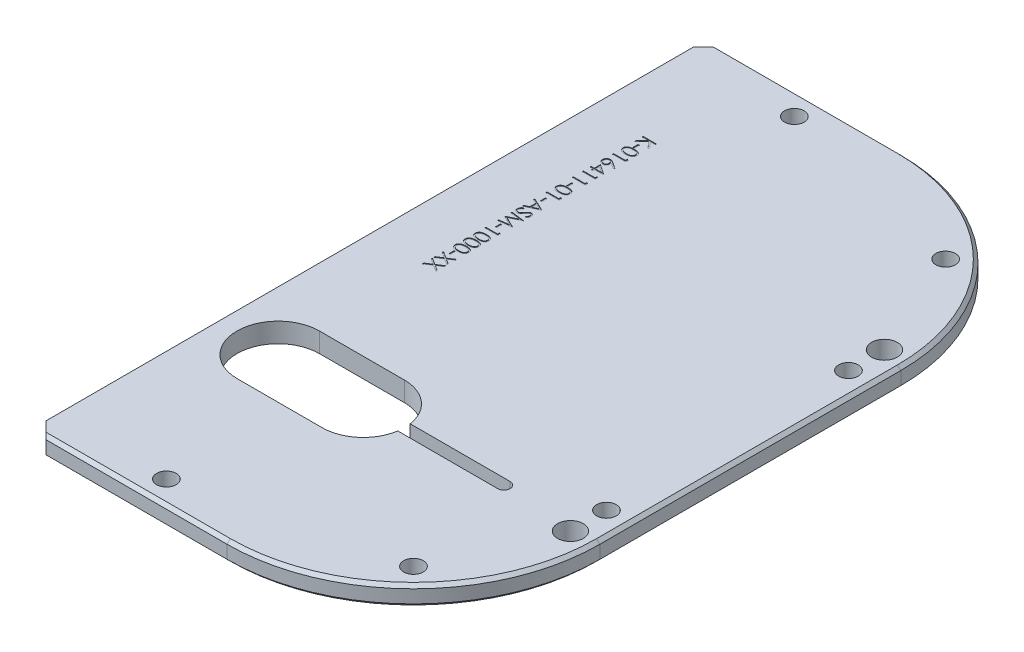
from build123d import *

# Parameters (mm, degrees)
SKETCH1_W             = 254
SKETCH1_H             = 330.2
BOSS_EXTRUDE1_DEPTH   = 4.7625
SKETCH2_OUTSIDE_W     = 339.34
SKETCH2_OUTSIDE_H     = 415.54
CUT_EXTRUDE1_DEPTH    = 9.525
CUT_EXTRUDE2_DEPTH    = 207.008328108
CUT_EXTRUDE3_DEPTH    = 207.008328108
HOLE1_D               = 9.525
HOLE1_DEPTH           = 88.9
SKETCH7_W             = 0.651282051
SKETCH7_H             = 2.442307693
SKETCH7_H_2           = 2.442307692
CUT_EXTRUDE4_DEPTH    = 0.254
MOVE_FACE1_BY         = 1.5875
MOVE_FACE1_2_BY       = 1.5875
MOVE_FACE1_3_BY       = 1.5875
MOVE_FACE1_4_BY       = 1.5875
MOVE_FACE1_5_BY       = 1.5875
CHAMFER2_SIZE         = 1.5875
M12_CLEARANCE_HOLE1_D = 12.5
CHAMFER3_SIZE         = 6.35


with BuildPart() as part:
    # Sketch1 → Boss-Extrude1 (new, symmetric)
    with BuildSketch(Plane(origin=(0, 0, 0), x_dir=(1, 0, 0), z_dir=(0, 1, 0))):
        Rectangle(SKETCH1_W, SKETCH1_H)
    extrude(amount=BOSS_EXTRUDE1_DEPTH, both=True)

    # Sketch2 outside → Cut-Extrude1 (cut)
    with BuildSketch(Plane(origin=(0, 4.7625, 0), x_dir=(1, 0, 0), z_dir=(0, 1, 0))):
        Rectangle(SKETCH2_OUTSIDE_W, SKETCH2_OUTSIDE_H)
        with BuildLine():
            Line((-127, -161.925), (-32.769613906, -161.925))
            ThreePointArc((-32.769613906, -161.925), (30.092178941, -135.886792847), (56.130386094, -73.025))
            Line((56.130386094, -73.025), (56.130386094, 73.025))
            ThreePointArc((56.130386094, 73.025), (30.092178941, 135.886792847), (-32.769613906, 161.925))
            Line((-32.769613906, 161.925), (-127, 161.925))
            Line((-127, 161.925), (-127, -161.925))
        make_face(mode=Mode.SUBTRACT)
    extrude(amount=-CUT_EXTRUDE1_DEPTH, mode=Mode.SUBTRACT)

    # Sketch3 → Cut-Extrude2 (cut, through all)
    with BuildSketch(Plane(origin=(0, 4.7625, 0), x_dir=(1, 0, 0), z_dir=(0, 1, 0))):
        with BuildLine():
            Line((-42.8625, -70.01), (11.1125, -70.01))
            ThreePointArc((11.1125, -70.01), (14.1275, -73.025), (11.1125, -76.04))
            Line((11.1125, -76.04), (-42.8625, -76.04))
            ThreePointArc((-42.8625, -76.04), (-45.8775, -73.025), (-42.8625, -70.01))
        make_face()
    extrude(amount=-CUT_EXTRUDE2_DEPTH, mode=Mode.SUBTRACT)

    # Sketch4 → Cut-Extrude3 (cut, through all)
    with BuildSketch(Plane(origin=(0, 4.7625, 0), x_dir=(1, 0, 0), z_dir=(0, 1, 0))):
        with BuildLine():
            Line((-98.425, -53.025), (-57.15, -53.025))
            ThreePointArc((-57.15, -53.025), (-37.15, -73.025), (-57.15, -93.025))
            Line((-57.15, -93.025), (-98.425, -93.025))
            ThreePointArc((-98.425, -93.025), (-118.425, -73.025), (-98.425, -53.025))
        make_face()
    extrude(amount=-CUT_EXTRUDE3_DEPTH, mode=Mode.SUBTRACT)

    # Hole1
    with Locations(Plane(origin=(0, 4.7625, 0), x_dir=(1, 0, 0), z_dir=(0, 1, 0))):
        with Locations((-73.314363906, 152.4), (23.356986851, 129.151600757), (46.605386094, 58.7375), (46.605386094, -58.7375), (23.356986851, -129.151600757), (-73.314363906, -152.4)):
            Hole(HOLE1_D / 2, depth=HOLE1_DEPTH)

    # Sketch7 → Cut-Extrude4 (cut)
    # profile 1 of 23: a face of its own
    with BuildSketch(Plane(origin=(0, 4.7625, 0), x_dir=(1, 0, 0), z_dir=(0, 1, 0))):
        Polygon((-95.25, 107.339423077), (-95.25, 106.769551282), (-97.668139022, 106.769551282), (-95.25, 104.122445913), (-95.25, 103.309615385), (-98.099358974, 106.429917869), (-101.6, 103.065384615), (-101.6, 103.824789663), (-98.535667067, 106.769551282), (-101.6, 106.769551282), (-101.6, 107.339423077), align=None)
    # profile 2 of 23: a face of its own
    with BuildSketch(Plane(origin=(0, 4.7625, 0), x_dir=(1, 0, 0), z_dir=(0, 1, 0))):
        with Locations((-99.157692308, 101.477884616)):
            Rectangle(SKETCH7_W, SKETCH7_H)
    # profile 3 of 23: a face of its own
    with BuildSketch(Plane(origin=(0, 4.7625, 0), x_dir=(1, 0, 0), z_dir=(0, 1, 0))):
        with BuildLine():
            add(Edge.make_bspline(
                [(-98.427544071, 99.768269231), (-98.325767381, 99.767674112), (-98.128064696, 99.766518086), (-97.839983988, 99.753657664), (-97.569727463, 99.73229383), (-97.31728219, 99.703016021), (-97.082582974, 99.667387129), (-96.866257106, 99.619824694), (-96.667303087, 99.565735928), (-96.485073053, 99.503047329), (-96.317108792, 99.432314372), (-96.160315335, 99.355319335), (-96.014891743, 99.269048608), (-95.878653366, 99.178285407), (-95.753120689, 99.079713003), (-95.63853144, 98.974371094), (-95.534816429, 98.861214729), (-95.440741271, 98.742481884), (-95.358789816, 98.617422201), (-95.284946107, 98.489890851), (-95.22433806, 98.357637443), (-95.174537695, 98.221868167), (-95.134633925, 98.082977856), (-95.107000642, 97.940392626), (-95.089682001, 97.794078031), (-95.088021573, 97.695324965), (-95.087179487, 97.645242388)],
                knots=[0, 0, 0, 0, 1.646377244, 3.198111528, 4.663803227, 6.031090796, 7.308794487, 8.502186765, 9.612154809, 10.642545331, 11.617106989, 12.558866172, 13.465886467, 14.35053239, 15.20542558, 16.045215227, 16.865619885, 17.686225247, 18.492864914, 19.282407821, 20.068097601, 20.842842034, 21.620163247, 22.403093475, 23.190129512, 24, 24, 24, 24], degree=3))
            add(Edge.make_bspline(
                [(-95.087179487, 97.645242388), (-95.088064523, 97.594740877), (-95.089824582, 97.494309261), (-95.106740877, 97.345827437), (-95.134809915, 97.200775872), (-95.174580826, 97.059772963), (-95.223921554, 96.921660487), (-95.285765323, 96.787518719), (-95.357754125, 96.656514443), (-95.44234316, 96.530729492), (-95.536653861, 96.408782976), (-95.643266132, 96.293670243), (-95.761103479, 96.185380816), (-95.888905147, 96.082555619), (-96.029122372, 95.988111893), (-96.1793164, 95.898171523), (-96.342113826, 95.817667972), (-96.514798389, 95.740135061), (-96.70214817, 95.673211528), (-96.903107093, 95.612857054), (-97.120048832, 95.564090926), (-97.351835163, 95.523470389), (-97.599317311, 95.492001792), (-97.861964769, 95.46908257), (-98.139950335, 95.456975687), (-98.330011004, 95.454695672), (-98.427544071, 95.453525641)],
                knots=[0, 0, 0, 0, 0.810914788, 1.612654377, 2.396697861, 3.181598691, 3.963628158, 4.749916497, 5.551656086, 6.361998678, 7.18212741, 8.025565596, 8.878627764, 9.750805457, 10.657531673, 11.591944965, 12.560506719, 13.57287815, 14.630710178, 15.753379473, 16.941251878, 18.199788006, 19.531962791, 20.947069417, 22.433333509, 24, 24, 24, 24], degree=3))
            add(Edge.make_bspline(
                [(-98.427544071, 95.453525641), (-98.524651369, 95.454709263), (-98.71386098, 95.457015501), (-98.990600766, 95.468930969), (-99.251836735, 95.492512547), (-99.498296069, 95.521679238), (-99.728515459, 95.563226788), (-99.944684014, 95.610459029), (-100.144936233, 95.669163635), (-100.331297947, 95.735174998), (-100.503136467, 95.811025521), (-100.664526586, 95.892240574), (-100.814598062, 95.981628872), (-100.954813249, 96.076635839), (-101.083723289, 96.178587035), (-101.201646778, 96.287335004), (-101.308505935, 96.402962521), (-101.404105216, 96.525184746), (-101.487709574, 96.65294847), (-101.562438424, 96.783515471), (-101.623076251, 96.919491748), (-101.674273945, 97.057855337), (-101.71413635, 97.199911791), (-101.74142987, 97.345521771), (-101.760624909, 97.494208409), (-101.762086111, 97.594723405), (-101.762820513, 97.645242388)],
                knots=[0, 0, 0, 0, 1.56130642, 3.042141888, 4.451772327, 5.777565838, 7.030558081, 8.211376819, 9.333164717, 10.383253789, 11.387583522, 12.350962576, 13.286244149, 14.193812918, 15.072134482, 15.925989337, 16.770211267, 17.600669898, 18.417446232, 19.22325363, 20.01647746, 20.807971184, 21.593601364, 22.38506573, 23.188331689, 24, 24, 24, 24], degree=3))
            add(Edge.make_bspline(
                [(-101.762820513, 97.645242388), (-101.761970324, 97.69532293), (-101.760293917, 97.794071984), (-101.743092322, 97.940415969), (-101.715042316, 98.082778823), (-101.676950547, 98.22144514), (-101.628538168, 98.356698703), (-101.566959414, 98.487214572), (-101.49553764, 98.61471641), (-101.414282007, 98.738622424), (-101.321165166, 98.856571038), (-101.218180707, 98.96923803), (-101.102745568, 99.073778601), (-100.976707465, 99.171115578), (-100.841135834, 99.263483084), (-100.694695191, 99.348908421), (-100.536432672, 99.425753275), (-100.367541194, 99.498071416), (-100.183971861, 99.561819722), (-99.983956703, 99.617705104), (-99.766389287, 99.664293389), (-99.531915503, 99.701759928), (-99.280359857, 99.732647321), (-99.011279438, 99.753556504), (-98.724906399, 99.766528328), (-98.528473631, 99.76767834), (-98.427544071, 99.768269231)],
                knots=[0, 0, 0, 0, 0.810940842, 1.599017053, 2.38298203, 3.159479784, 3.926441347, 4.70693857, 5.494146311, 6.292334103, 7.104379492, 7.925868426, 8.762126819, 9.623561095, 10.503686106, 11.41783325, 12.366995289, 13.351843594, 14.392337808, 15.512229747, 16.713911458, 17.994391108, 19.357476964, 20.818259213, 22.365182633, 24, 24, 24, 24], degree=3))
        make_face()
        with BuildLine():
            add(Edge.make_bspline(
                [(-98.425, 99.198397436), (-98.509815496, 99.198180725), (-98.674425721, 99.197760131), (-98.913627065, 99.186772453), (-99.136730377, 99.171804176), (-99.344018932, 99.152497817), (-99.534791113, 99.123826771), (-99.710358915, 99.091701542), (-99.869793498, 99.052607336), (-100.014187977, 99.006351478), (-100.145996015, 98.953668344), (-100.268637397, 98.896137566), (-100.383599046, 98.834367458), (-100.48971333, 98.765116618), (-100.588036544, 98.689955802), (-100.678286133, 98.608761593), (-100.760068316, 98.521676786), (-100.857110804, 98.401122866), (-100.958577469, 98.242753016), (-101.045846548, 98.042189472), (-101.101044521, 97.836011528), (-101.108044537, 97.696030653), (-101.111538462, 97.626161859)],
                knots=[0, 0, 0, 0, 1.459116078, 2.831857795, 4.118796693, 5.306371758, 6.412361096, 7.436813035, 8.376339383, 9.234574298, 10.043323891, 10.816788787, 11.564361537, 12.286735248, 12.994408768, 13.691741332, 14.372975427, 15.047457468, 16.352811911, 17.594285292, 18.799233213, 20, 20, 20, 20], degree=3))
            add(Edge.make_bspline(
                [(-101.111538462, 97.626161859), (-101.108639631, 97.555844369), (-101.102847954, 97.415354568), (-101.046970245, 97.21009754), (-100.962661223, 97.01083405), (-100.862970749, 96.854674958), (-100.768032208, 96.735870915), (-100.687088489, 96.65075009), (-100.596454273, 96.572623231), (-100.49866555, 96.498524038), (-100.391854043, 96.430562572), (-100.276533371, 96.368762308), (-100.152383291, 96.312368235), (-100.065715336, 96.280238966), (-100.021404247, 96.263812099)],
                knots=[0, 0, 0, 0, 1.353760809, 2.704726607, 4.075137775, 5.516104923, 6.260822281, 7.007110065, 7.778089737, 8.566572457, 9.372053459, 10.217411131, 11.088608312, 12, 12, 12, 12], degree=3))
            add(Edge.make_bspline(
                [(-100.021404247, 96.263812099), (-99.964744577, 96.244668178), (-99.849701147, 96.205797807), (-99.671241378, 96.155702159), (-99.484002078, 96.116249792), (-99.289102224, 96.080756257), (-99.08510448, 96.056529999), (-98.872640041, 96.037030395), (-98.651548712, 96.02554472), (-98.501334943, 96.024120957), (-98.425, 96.023397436)],
                knots=[0, 0, 0, 0, 0.884706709, 1.796334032, 2.740027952, 3.714592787, 4.726048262, 5.777819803, 6.87074269, 8, 8, 8, 8], degree=3))
            add(Edge.make_bspline(
                [(-98.425, 96.023397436), (-98.348666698, 96.024195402), (-98.19932397, 96.025756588), (-97.980835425, 96.036013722), (-97.772955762, 96.052496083), (-97.575496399, 96.074804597), (-97.388808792, 96.105429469), (-97.212625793, 96.142206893), (-97.0469949, 96.185324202), (-96.891488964, 96.234781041), (-96.746666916, 96.290518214), (-96.612213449, 96.352091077), (-96.48741577, 96.417797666), (-96.372632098, 96.489178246), (-96.267344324, 96.565369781), (-96.173664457, 96.64838721), (-96.088688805, 96.734936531), (-95.991692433, 96.856162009), (-95.892792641, 97.014865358), (-95.80177762, 97.212342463), (-95.749511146, 97.417847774), (-95.742142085, 97.556773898), (-95.738461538, 97.626161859)],
                knots=[0, 0, 0, 0, 1.313668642, 2.570134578, 3.763346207, 4.902004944, 5.98888779, 7.017888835, 7.998425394, 8.933058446, 9.82474457, 10.667209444, 11.476765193, 12.250262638, 12.991704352, 13.7104269, 14.401925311, 15.076585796, 16.378385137, 17.609787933, 18.806186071, 20, 20, 20, 20], degree=3))
            add(Edge.make_bspline(
                [(-95.738461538, 97.626161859), (-95.742142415, 97.696396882), (-95.749510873, 97.83699488), (-95.801640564, 98.044591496), (-95.89194527, 98.243475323), (-95.992331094, 98.40090541), (-96.086971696, 98.521977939), (-96.169271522, 98.607472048), (-96.25979413, 98.687400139), (-96.357701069, 98.762623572), (-96.463868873, 98.831807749), (-96.578813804, 98.893603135), (-96.701466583, 98.95110089), (-96.833244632, 99.003897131), (-96.977856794, 99.049724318), (-97.136486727, 99.09068537), (-97.312218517, 99.122791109), (-97.503524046, 99.150807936), (-97.711067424, 99.172169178), (-97.934685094, 99.186734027), (-98.174300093, 99.197780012), (-98.339759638, 99.198187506), (-98.425, 99.198397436)],
                knots=[0, 0, 0, 0, 1.207964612, 2.418129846, 3.655795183, 4.951004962, 5.620895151, 6.296795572, 6.989224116, 7.696855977, 8.419187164, 9.166715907, 9.940135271, 10.748837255, 11.607021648, 12.548275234, 13.5654991, 14.678641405, 15.874140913, 17.15372626, 18.533675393, 20, 20, 20, 20], degree=3))
        make_face(mode=Mode.SUBTRACT)
    # profile 4 of 23: a face of its own
    with BuildSketch(Plane(origin=(0, 4.7625, 0), x_dir=(1, 0, 0), z_dir=(0, 1, 0))):
        Polygon((-95.25, 93.534024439), (-95.25, 92.359935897), (-101.6, 92.359935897), (-101.6, 92.929807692), (-95.901282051, 92.929807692), (-95.901282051, 93.906730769), align=None)
    # profile 5 of 23: a face of its own
    with BuildSketch(Plane(origin=(0, 4.7625, 0), x_dir=(1, 0, 0), z_dir=(0, 1, 0))):
        with BuildLine():
            Line((-95.087179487, 87.068269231), (-95.431901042, 86.629417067))
            Line((-95.431901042, 86.629417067), (-97.997596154, 88.307231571))
            add(Edge.make_bspline(
                [(-97.997596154, 88.307231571), (-97.979791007, 88.195525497), (-97.945060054, 87.977630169), (-97.939330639, 87.757074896), (-97.936538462, 87.649589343)],
                knots=[0, 0, 0, 0, 1.025318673, 2, 2, 2, 2], degree=3))
            add(Edge.make_bspline(
                [(-97.936538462, 87.649589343), (-97.938273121, 87.585050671), (-97.941687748, 87.458008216), (-97.967965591, 87.271487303), (-98.009376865, 87.092255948), (-98.069742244, 86.921057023), (-98.146853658, 86.757276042), (-98.239271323, 86.599973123), (-98.351767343, 86.45210519), (-98.477433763, 86.311768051), (-98.616620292, 86.184356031), (-98.764305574, 86.071550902), (-98.920335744, 85.97679658), (-99.084631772, 85.899918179), (-99.2569404, 85.840219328), (-99.437041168, 85.796698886), (-99.625058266, 85.770973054), (-99.752925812, 85.767479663), (-99.817878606, 85.765705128)],
                knots=[0, 0, 0, 0, 1.04369286, 2.054478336, 3.041073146, 4.015093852, 4.984733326, 5.965804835, 6.960378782, 7.985147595, 9.009457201, 10.008161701, 10.986880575, 11.956520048, 12.937015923, 13.931873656, 14.949455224, 16, 16, 16, 16], degree=3))
            add(Edge.make_bspline(
                [(-99.817878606, 85.765705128), (-99.906688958, 85.769018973), (-100.081343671, 85.775535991), (-100.336790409, 85.822977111), (-100.578195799, 85.904849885), (-100.806508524, 86.014385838), (-101.015085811, 86.156500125), (-101.20358375, 86.324913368), (-101.367887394, 86.521217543), (-101.508836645, 86.740764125), (-101.620820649, 86.978381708), (-101.703612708, 87.227531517), (-101.753083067, 87.486083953), (-101.759559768, 87.661676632), (-101.762820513, 87.750080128)],
                knots=[0, 0, 0, 0, 1.031881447, 2.029301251, 3.006342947, 3.987068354, 4.962916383, 5.929513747, 6.915671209, 7.928552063, 8.953527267, 9.960179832, 10.973036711, 12, 12, 12, 12], degree=3))
            add(Edge.make_bspline(
                [(-101.762820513, 87.750080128), (-101.760047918, 87.835527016), (-101.754555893, 88.00478234), (-101.705631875, 88.253761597), (-101.62633509, 88.492999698), (-101.517087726, 88.720814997), (-101.379102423, 88.931866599), (-101.212962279, 89.1206243), (-101.022339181, 89.286431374), (-100.806648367, 89.423690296), (-100.576367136, 89.53555669), (-100.334061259, 89.614457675), (-100.084607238, 89.665483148), (-99.914800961, 89.67074754), (-99.829326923, 89.673397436)],
                knots=[0, 0, 0, 0, 1.011913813, 2.004424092, 2.994488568, 3.992479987, 4.990471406, 5.973328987, 6.963763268, 7.974390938, 8.994854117, 9.989689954, 10.988086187, 12, 12, 12, 12], degree=3))
            add(Edge.make_bspline(
                [(-99.829326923, 89.673397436), (-99.763955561, 89.671096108), (-99.630539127, 89.666399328), (-99.427891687, 89.638369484), (-99.221352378, 89.586959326), (-99.04626355, 89.531322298), (-98.901258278, 89.476113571), (-98.786751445, 89.42492277), (-98.665828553, 89.367685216), (-98.540777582, 89.300594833), (-98.408025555, 89.229473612), (-98.272488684, 89.146395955), (-98.129216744, 89.059703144), (-98.033828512, 88.9961942), (-97.984875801, 88.963601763)],
                knots=[0, 0, 0, 0, 1.17367173, 2.395347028, 3.66355231, 4.98980831, 5.690886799, 6.447442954, 7.240630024, 8.091733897, 8.994365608, 9.943299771, 10.944512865, 12, 12, 12, 12], degree=3))
            Line((-97.984875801, 88.963601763), (-95.087179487, 87.068269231))
        make_face()
        with BuildLine():
            add(Edge.make_bspline(
                [(-98.587820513, 87.769160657), (-98.589250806, 87.817532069), (-98.592057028, 87.912436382), (-98.607906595, 88.05149908), (-98.637937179, 88.182757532), (-98.67678243, 88.307710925), (-98.729672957, 88.425056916), (-98.793156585, 88.536134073), (-98.868634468, 88.63984019), (-98.955265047, 88.734354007), (-99.048727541, 88.821141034), (-99.149433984, 88.895792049), (-99.254307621, 88.960256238), (-99.364334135, 89.012651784), (-99.47944295, 89.053456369), (-99.599112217, 89.082971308), (-99.724142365, 89.099397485), (-99.80892849, 89.102130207), (-99.852223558, 89.103525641)],
                knots=[0, 0, 0, 0, 1.129474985, 2.216020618, 3.260639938, 4.268601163, 5.26556745, 6.258792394, 7.250684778, 8.252748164, 9.247500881, 10.223461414, 11.174097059, 12.117127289, 13.062595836, 14.020469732, 14.98917545, 16, 16, 16, 16], degree=3))
            add(Edge.make_bspline(
                [(-99.852223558, 89.103525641), (-99.895129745, 89.102386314), (-99.979262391, 89.100152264), (-100.103272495, 89.079960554), (-100.222501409, 89.048897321), (-100.337036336, 89.003428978), (-100.446252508, 88.946398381), (-100.550925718, 88.876215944), (-100.651128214, 88.794070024), (-100.744333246, 88.698577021), (-100.829823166, 88.595597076), (-100.905943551, 88.486688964), (-100.969864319, 88.372198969), (-101.020398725, 88.251473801), (-101.061787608, 88.126203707), (-101.09093347, 87.995433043), (-101.107406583, 87.859046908), (-101.110143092, 87.766660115), (-101.111538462, 87.719551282)],
                knots=[0, 0, 0, 0, 0.989642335, 1.94054129, 2.892446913, 3.828371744, 4.778262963, 5.730973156, 6.732161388, 7.763274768, 8.805796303, 9.818398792, 10.825975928, 11.825728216, 12.834635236, 13.867465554, 14.912602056, 16, 16, 16, 16], degree=3))
            add(Edge.make_bspline(
                [(-101.111538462, 87.719551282), (-101.110143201, 87.672442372), (-101.107406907, 87.580055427), (-101.090932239, 87.443670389), (-101.061792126, 87.31289567), (-101.020382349, 87.187640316), (-100.969925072, 87.066860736), (-100.905543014, 86.952270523), (-100.830285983, 86.842322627), (-100.744186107, 86.73941024), (-100.651654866, 86.643518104), (-100.550018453, 86.563296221), (-100.447084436, 86.490896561), (-100.336601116, 86.43605635), (-100.222570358, 86.390081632), (-100.103254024, 86.359175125), (-99.979267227, 86.33894163), (-99.895131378, 86.336713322), (-99.852223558, 86.335576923)],
                knots=[0, 0, 0, 0, 1.087205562, 2.132157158, 3.164804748, 4.173533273, 5.173108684, 6.180507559, 7.20098426, 8.243321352, 9.274252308, 10.269075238, 11.227079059, 12.172305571, 13.108064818, 14.05980203, 15.010532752, 16, 16, 16, 16], degree=3))
            add(Edge.make_bspline(
                [(-99.852223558, 86.335576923), (-99.808866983, 86.336563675), (-99.723772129, 86.338500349), (-99.599224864, 86.360829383), (-99.478469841, 86.39098846), (-99.364227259, 86.439728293), (-99.253337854, 86.497781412), (-99.148970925, 86.571737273), (-99.048169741, 86.656529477), (-98.954645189, 86.754727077), (-98.869100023, 86.861557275), (-98.793592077, 86.975163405), (-98.729864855, 87.094012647), (-98.676693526, 87.217990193), (-98.638322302, 87.348515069), (-98.608108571, 87.483480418), (-98.592030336, 87.624612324), (-98.589241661, 87.720364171), (-98.587820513, 87.769160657)],
                knots=[0, 0, 0, 0, 0.978265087, 1.920016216, 2.851775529, 3.783928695, 4.718195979, 5.674835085, 6.667117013, 7.690134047, 8.732874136, 9.755756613, 10.767227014, 11.776017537, 12.797239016, 13.836276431, 14.897336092, 16, 16, 16, 16], degree=3))
        make_face(mode=Mode.SUBTRACT)
    # profile 6 of 23: a face of its own
    with BuildSketch(Plane(origin=(0, 4.7625, 0), x_dir=(1, 0, 0), z_dir=(0, 1, 0))):
        Polygon((-95.087179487, 81.648127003), (-95.087179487, 81.532371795), (-99.483333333, 81.532371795), (-99.483333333, 80.799679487), (-100.134615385, 80.799679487), (-100.134615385, 81.532371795), (-101.6, 81.532371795), (-101.6, 82.10224359), (-100.134615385, 82.10224359), (-100.134615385, 85.114423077), align=None)
        Polygon((-99.483333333, 82.10224359), (-96.725560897, 82.10224359), (-99.483333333, 83.995032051), align=None, mode=Mode.SUBTRACT)
    # profile 7 of 23: a face of its own
    with BuildSketch(Plane(origin=(0, 4.7625, 0), x_dir=(1, 0, 0), z_dir=(0, 1, 0))):
        Polygon((-95.25, 78.880178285), (-95.25, 77.706089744), (-101.6, 77.706089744), (-101.6, 78.275961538), (-95.901282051, 78.275961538), (-95.901282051, 79.252884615), align=None)
    # profile 8 of 23: a face of its own
    with BuildSketch(Plane(origin=(0, 4.7625, 0), x_dir=(1, 0, 0), z_dir=(0, 1, 0))):
        Polygon((-95.25, 73.995562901), (-95.25, 72.821474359), (-101.6, 72.821474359), (-101.6, 73.391346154), (-95.901282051, 73.391346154), (-95.901282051, 74.368269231), align=None)
    # profile 9 of 23: a face of its own
    with BuildSketch(Plane(origin=(0, 4.7625, 0), x_dir=(1, 0, 0), z_dir=(0, 1, 0))):
        with Locations((-99.157692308, 69.239423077)):
            Rectangle(SKETCH7_W, SKETCH7_H_2)
    # profile 10 of 23: a face of its own
    with BuildSketch(Plane(origin=(0, 4.7625, 0), x_dir=(1, 0, 0), z_dir=(0, 1, 0))):
        with BuildLine():
            add(Edge.make_bspline(
                [(-98.427544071, 67.529807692), (-98.325767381, 67.529212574), (-98.128064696, 67.528056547), (-97.839983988, 67.515196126), (-97.569727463, 67.493832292), (-97.31728219, 67.464554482), (-97.082582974, 67.428925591), (-96.866257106, 67.381363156), (-96.667303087, 67.327274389), (-96.485073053, 67.264585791), (-96.317108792, 67.193852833), (-96.160315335, 67.116857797), (-96.014891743, 67.030587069), (-95.878653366, 66.939823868), (-95.753120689, 66.841251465), (-95.63853144, 66.735909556), (-95.534816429, 66.622753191), (-95.440741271, 66.504020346), (-95.358789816, 66.378960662), (-95.284946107, 66.251429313), (-95.22433806, 66.119175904), (-95.174537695, 65.983406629), (-95.134633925, 65.844516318), (-95.107000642, 65.701931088), (-95.089682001, 65.555616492), (-95.088021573, 65.456863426), (-95.087179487, 65.406780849)],
                knots=[0, 0, 0, 0, 1.646377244, 3.198111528, 4.663803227, 6.031090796, 7.308794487, 8.502186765, 9.612154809, 10.642545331, 11.617106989, 12.558866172, 13.465886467, 14.35053239, 15.20542558, 16.045215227, 16.865619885, 17.686225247, 18.492864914, 19.282407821, 20.068097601, 20.842842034, 21.620163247, 22.403093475, 23.190129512, 24, 24, 24, 24], degree=3))
            add(Edge.make_bspline(
                [(-95.087179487, 65.406780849), (-95.088064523, 65.356279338), (-95.089824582, 65.255847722), (-95.106740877, 65.107365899), (-95.134809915, 64.962314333), (-95.174580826, 64.821311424), (-95.223921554, 64.683198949), (-95.285765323, 64.549057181), (-95.357754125, 64.418052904), (-95.44234316, 64.292267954), (-95.536653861, 64.170321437), (-95.643266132, 64.055208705), (-95.761103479, 63.946919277), (-95.888905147, 63.84409408), (-96.029122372, 63.749650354), (-96.1793164, 63.659709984), (-96.342113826, 63.579206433), (-96.514798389, 63.501673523), (-96.70214817, 63.43474999), (-96.903107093, 63.374395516), (-97.120048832, 63.325629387), (-97.351835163, 63.28500885), (-97.599317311, 63.253540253), (-97.861964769, 63.230621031), (-98.139950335, 63.218514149), (-98.330011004, 63.216234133), (-98.427544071, 63.215064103)],
                knots=[0, 0, 0, 0, 0.810914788, 1.612654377, 2.396697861, 3.181598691, 3.963628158, 4.749916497, 5.551656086, 6.361998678, 7.18212741, 8.025565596, 8.878627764, 9.750805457, 10.657531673, 11.591944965, 12.560506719, 13.57287815, 14.630710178, 15.753379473, 16.941251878, 18.199788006, 19.531962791, 20.947069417, 22.433333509, 24, 24, 24, 24], degree=3))
            add(Edge.make_bspline(
                [(-98.427544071, 63.215064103), (-98.524651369, 63.216247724), (-98.71386098, 63.218553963), (-98.990600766, 63.23046943), (-99.251836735, 63.254051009), (-99.498296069, 63.2832177), (-99.728515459, 63.324765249), (-99.944684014, 63.371997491), (-100.144936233, 63.430702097), (-100.331297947, 63.496713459), (-100.503136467, 63.572563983), (-100.664526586, 63.653779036), (-100.814598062, 63.743167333), (-100.954813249, 63.838174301), (-101.083723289, 63.940125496), (-101.201646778, 64.048873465), (-101.308505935, 64.164500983), (-101.404105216, 64.286723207), (-101.487709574, 64.414486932), (-101.562438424, 64.545053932), (-101.623076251, 64.681030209), (-101.674273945, 64.819393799), (-101.71413635, 64.961450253), (-101.74142987, 65.107060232), (-101.760624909, 65.25574687), (-101.762086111, 65.356261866), (-101.762820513, 65.406780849)],
                knots=[0, 0, 0, 0, 1.56130642, 3.042141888, 4.451772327, 5.777565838, 7.030558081, 8.211376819, 9.333164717, 10.383253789, 11.387583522, 12.350962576, 13.286244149, 14.193812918, 15.072134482, 15.925989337, 16.770211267, 17.600669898, 18.417446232, 19.22325363, 20.01647746, 20.807971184, 21.593601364, 22.38506573, 23.188331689, 24, 24, 24, 24], degree=3))
            add(Edge.make_bspline(
                [(-101.762820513, 65.406780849), (-101.761970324, 65.456861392), (-101.760293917, 65.555610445), (-101.743092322, 65.70195443), (-101.715042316, 65.844317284), (-101.676950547, 65.982983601), (-101.628538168, 66.118237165), (-101.566959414, 66.248753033), (-101.49553764, 66.376254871), (-101.414282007, 66.500160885), (-101.321165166, 66.618109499), (-101.218180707, 66.730776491), (-101.102745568, 66.835317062), (-100.976707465, 66.932654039), (-100.841135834, 67.025021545), (-100.694695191, 67.110446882), (-100.536432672, 67.187291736), (-100.367541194, 67.259609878), (-100.183971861, 67.323358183), (-99.983956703, 67.379243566), (-99.766389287, 67.42583185), (-99.531915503, 67.46329839), (-99.280359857, 67.494185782), (-99.011279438, 67.515094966), (-98.724906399, 67.528066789), (-98.528473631, 67.529216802), (-98.427544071, 67.529807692)],
                knots=[0, 0, 0, 0, 0.810940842, 1.599017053, 2.38298203, 3.159479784, 3.926441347, 4.70693857, 5.494146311, 6.292334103, 7.104379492, 7.925868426, 8.762126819, 9.623561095, 10.503686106, 11.41783325, 12.366995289, 13.351843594, 14.392337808, 15.512229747, 16.713911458, 17.994391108, 19.357476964, 20.818259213, 22.365182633, 24, 24, 24, 24], degree=3))
        make_face()
        with BuildLine():
            add(Edge.make_bspline(
                [(-98.425, 66.959935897), (-98.509815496, 66.959719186), (-98.674425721, 66.959298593), (-98.913627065, 66.948310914), (-99.136730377, 66.933342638), (-99.344018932, 66.914036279), (-99.534791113, 66.885365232), (-99.710358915, 66.853240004), (-99.869793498, 66.814145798), (-100.014187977, 66.76788994), (-100.145996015, 66.715206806), (-100.268637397, 66.657676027), (-100.383599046, 66.59590592), (-100.48971333, 66.526655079), (-100.588036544, 66.451494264), (-100.678286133, 66.370300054), (-100.760068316, 66.283215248), (-100.857110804, 66.162661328), (-100.958577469, 66.004291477), (-101.045846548, 65.803727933), (-101.101044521, 65.59754999), (-101.108044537, 65.457569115), (-101.111538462, 65.387700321)],
                knots=[0, 0, 0, 0, 1.459116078, 2.831857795, 4.118796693, 5.306371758, 6.412361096, 7.436813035, 8.376339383, 9.234574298, 10.043323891, 10.816788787, 11.564361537, 12.286735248, 12.994408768, 13.691741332, 14.372975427, 15.047457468, 16.352811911, 17.594285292, 18.799233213, 20, 20, 20, 20], degree=3))
            add(Edge.make_bspline(
                [(-101.111538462, 65.387700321), (-101.108639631, 65.317382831), (-101.102847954, 65.17689303), (-101.046970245, 64.971636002), (-100.962661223, 64.772372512), (-100.862970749, 64.61621342), (-100.768032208, 64.497409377), (-100.687088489, 64.412288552), (-100.596454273, 64.334161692), (-100.49866555, 64.2600625), (-100.391854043, 64.192101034), (-100.276533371, 64.13030077), (-100.152383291, 64.073906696), (-100.065715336, 64.041777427), (-100.021404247, 64.025350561)],
                knots=[0, 0, 0, 0, 1.353760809, 2.704726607, 4.075137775, 5.516104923, 6.260822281, 7.007110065, 7.778089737, 8.566572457, 9.372053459, 10.217411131, 11.088608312, 12, 12, 12, 12], degree=3))
            add(Edge.make_bspline(
                [(-100.021404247, 64.025350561), (-99.964744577, 64.006206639), (-99.849701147, 63.967336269), (-99.671241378, 63.917240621), (-99.484002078, 63.877788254), (-99.289102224, 63.842294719), (-99.08510448, 63.81806846), (-98.872640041, 63.798568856), (-98.651548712, 63.787083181), (-98.501334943, 63.785659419), (-98.425, 63.784935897)],
                knots=[0, 0, 0, 0, 0.884706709, 1.796334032, 2.740027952, 3.714592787, 4.726048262, 5.777819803, 6.87074269, 8, 8, 8, 8], degree=3))
            add(Edge.make_bspline(
                [(-98.425, 63.784935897), (-98.348666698, 63.785733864), (-98.19932397, 63.78729505), (-97.980835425, 63.797552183), (-97.772955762, 63.814034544), (-97.575496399, 63.836343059), (-97.388808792, 63.866967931), (-97.212625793, 63.903745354), (-97.0469949, 63.946862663), (-96.891488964, 63.996319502), (-96.746666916, 64.052056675), (-96.612213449, 64.113629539), (-96.48741577, 64.179336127), (-96.372632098, 64.250716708), (-96.267344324, 64.326908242), (-96.173664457, 64.409925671), (-96.088688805, 64.496474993), (-95.991692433, 64.617700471), (-95.892792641, 64.776403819), (-95.80177762, 64.973880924), (-95.749511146, 65.179386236), (-95.742142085, 65.318312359), (-95.738461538, 65.387700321)],
                knots=[0, 0, 0, 0, 1.313668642, 2.570134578, 3.763346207, 4.902004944, 5.98888779, 7.017888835, 7.998425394, 8.933058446, 9.82474457, 10.667209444, 11.476765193, 12.250262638, 12.991704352, 13.7104269, 14.401925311, 15.076585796, 16.378385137, 17.609787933, 18.806186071, 20, 20, 20, 20], degree=3))
            add(Edge.make_bspline(
                [(-95.738461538, 65.387700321), (-95.742142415, 65.457935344), (-95.749510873, 65.598533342), (-95.801640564, 65.806129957), (-95.89194527, 66.005013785), (-95.992331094, 66.162443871), (-96.086971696, 66.283516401), (-96.169271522, 66.36901051), (-96.25979413, 66.4489386), (-96.357701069, 66.524162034), (-96.463868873, 66.59334621), (-96.578813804, 66.655141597), (-96.701466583, 66.712639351), (-96.833244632, 66.765435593), (-96.977856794, 66.81126278), (-97.136486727, 66.852223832), (-97.312218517, 66.88432957), (-97.503524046, 66.912346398), (-97.711067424, 66.933707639), (-97.934685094, 66.948272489), (-98.174300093, 66.959318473), (-98.339759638, 66.959725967), (-98.425, 66.959935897)],
                knots=[0, 0, 0, 0, 1.207964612, 2.418129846, 3.655795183, 4.951004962, 5.620895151, 6.296795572, 6.989224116, 7.696855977, 8.419187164, 9.166715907, 9.940135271, 10.748837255, 11.607021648, 12.548275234, 13.5654991, 14.678641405, 15.874140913, 17.15372626, 18.533675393, 20, 20, 20, 20], degree=3))
        make_face(mode=Mode.SUBTRACT)
    # profile 11 of 23: a face of its own
    with BuildSketch(Plane(origin=(0, 4.7625, 0), x_dir=(1, 0, 0), z_dir=(0, 1, 0))):
        Polygon((-95.25, 61.295562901), (-95.25, 60.121474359), (-101.6, 60.121474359), (-101.6, 60.691346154), (-95.901282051, 60.691346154), (-95.901282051, 61.668269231), align=None)
    # profile 12 of 23: a face of its own
    with BuildSketch(Plane(origin=(0, 4.7625, 0), x_dir=(1, 0, 0), z_dir=(0, 1, 0))):
        with Locations((-99.157692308, 56.539423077)):
            Rectangle(SKETCH7_W, SKETCH7_H_2)
    # profile 13 of 23: a face of its own
    with BuildSketch(Plane(origin=(0, 4.7625, 0), x_dir=(1, 0, 0), z_dir=(0, 1, 0))):
        Polygon((-95.25, 51.654807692), (-101.6, 48.724038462), (-101.6, 49.343519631), (-99.56474359, 50.282281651), (-99.56474359, 53.160897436), (-101.6, 54.126372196), (-101.6, 54.748397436), (-95.25, 51.736217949), align=None)
        Polygon((-96.487690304, 51.701872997), (-98.913461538, 52.851792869), (-98.913461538, 50.582481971), align=None, mode=Mode.SUBTRACT)
    # profile 14 of 23: a face of its own
    with BuildSketch(Plane(origin=(0, 4.7625, 0), x_dir=(1, 0, 0), z_dir=(0, 1, 0))):
        with BuildLine():
            Line((-100.375030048, 48.398397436), (-100.053205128, 47.861598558))
            add(Edge.make_bspline(
                [(-100.053205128, 47.861598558), (-100.136779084, 47.811672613), (-100.296903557, 47.71601643), (-100.513271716, 47.556447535), (-100.697171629, 47.391106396), (-100.847533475, 47.218768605), (-100.965913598, 47.0404861), (-101.049737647, 46.855095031), (-101.102018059, 46.663220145), (-101.108368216, 46.532639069), (-101.111538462, 46.467447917)],
                knots=[0, 0, 0, 0, 1.272034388, 2.437168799, 3.508375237, 4.49857839, 5.41946034, 6.295179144, 7.148887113, 8, 8, 8, 8], degree=3))
            add(Edge.make_bspline(
                [(-101.111538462, 46.467447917), (-101.109987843, 46.411773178), (-101.106913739, 46.301397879), (-101.077375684, 46.138906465), (-101.031996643, 45.981096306), (-100.967006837, 45.831221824), (-100.888379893, 45.691344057), (-100.793403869, 45.568701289), (-100.687093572, 45.462609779), (-100.568404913, 45.376065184), (-100.441200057, 45.308880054), (-100.309462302, 45.260263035), (-100.173771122, 45.229321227), (-100.081776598, 45.225382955), (-100.035396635, 45.223397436)],
                knots=[0, 0, 0, 0, 1.095270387, 2.171376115, 3.241375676, 4.322296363, 5.380636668, 6.392615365, 7.366724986, 8.328592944, 9.273498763, 10.190095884, 11.087518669, 12, 12, 12, 12], degree=3))
            add(Edge.make_bspline(
                [(-100.035396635, 45.223397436), (-99.982526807, 45.226072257), (-99.875050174, 45.231509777), (-99.716482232, 45.277468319), (-99.559559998, 45.349766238), (-99.462493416, 45.416464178), (-99.412099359, 45.451091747)],
                knots=[0, 0, 0, 0, 0.938893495, 1.908633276, 2.914225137, 4, 4, 4, 4], degree=3))
            add(Edge.make_bspline(
                [(-99.412099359, 45.451091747), (-99.375654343, 45.479442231), (-99.298918, 45.539135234), (-99.18660379, 45.64317851), (-99.067920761, 45.76208992), (-98.943350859, 45.896463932), (-98.81516904, 46.048971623), (-98.680703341, 46.216481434), (-98.540357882, 46.399860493), (-98.4475488, 46.529097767), (-98.399559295, 46.595923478)],
                knots=[0, 0, 0, 0, 0.72226686, 1.520759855, 2.393439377, 3.351307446, 4.386958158, 5.510256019, 6.712608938, 8, 8, 8, 8], degree=3))
            add(Edge.make_bspline(
                [(-98.399559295, 46.595923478), (-98.351962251, 46.662723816), (-98.260960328, 46.790440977), (-98.126074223, 46.969188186), (-98.001964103, 47.128813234), (-97.890358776, 47.27012949), (-97.786390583, 47.389480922), (-97.695631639, 47.491230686), (-97.613235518, 47.571624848), (-97.55982663, 47.616362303), (-97.535847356, 47.636448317)],
                knots=[0, 0, 0, 0, 1.452255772, 2.776602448, 3.96446981, 5.032613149, 5.964194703, 6.766668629, 7.446264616, 8, 8, 8, 8], degree=3))
            add(Edge.make_bspline(
                [(-97.535847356, 47.636448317), (-97.498471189, 47.664519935), (-97.424965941, 47.719726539), (-97.310076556, 47.792599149), (-97.192468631, 47.854537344), (-97.071826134, 47.903091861), (-96.949842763, 47.943979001), (-96.824926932, 47.971479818), (-96.697639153, 47.988699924), (-96.611980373, 47.990463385), (-96.569100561, 47.991346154)],
                knots=[0, 0, 0, 0, 1.068054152, 2.10047183, 3.106115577, 4.101338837, 5.06977816, 6.043150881, 7.020423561, 8, 8, 8, 8], degree=3))
            add(Edge.make_bspline(
                [(-96.569100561, 47.991346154), (-96.501912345, 47.988988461), (-96.368972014, 47.98432347), (-96.174869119, 47.944548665), (-95.988987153, 47.882502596), (-95.815420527, 47.792765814), (-95.65457513, 47.681817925), (-95.508908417, 47.550694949), (-95.385408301, 47.395015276), (-95.278755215, 47.22325216), (-95.194548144, 47.036457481), (-95.130689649, 46.841069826), (-95.094988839, 46.636232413), (-95.089808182, 46.497258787), (-95.087179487, 46.426742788)],
                knots=[0, 0, 0, 0, 1.005541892, 1.989591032, 2.955705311, 3.932863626, 4.905387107, 5.876519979, 6.856563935, 7.871847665, 8.897921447, 9.918317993, 10.943742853, 12, 12, 12, 12], degree=3))
            add(Edge.make_bspline(
                [(-95.087179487, 46.426742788), (-95.089712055, 46.351903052), (-95.09473444, 46.203486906), (-95.139966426, 45.984763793), (-95.213030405, 45.773773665), (-95.297182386, 45.60393695), (-95.380853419, 45.471245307), (-95.457094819, 45.370059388), (-95.544859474, 45.267520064), (-95.644390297, 45.162803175), (-95.756597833, 45.057682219), (-95.88071441, 44.950596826), (-96.015981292, 44.841296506), (-96.112545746, 44.770982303), (-96.162049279, 44.734935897)],
                knots=[0, 0, 0, 0, 1.286821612, 2.551921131, 3.825787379, 5.12137259, 5.803616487, 6.523126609, 7.299589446, 8.125436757, 9.008162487, 9.944516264, 10.946261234, 12, 12, 12, 12], degree=3))
            Line((-96.162049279, 44.734935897), (-96.552564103, 45.250110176))
            add(Edge.make_bspline(
                [(-96.552564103, 45.250110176), (-96.512488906, 45.281217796), (-96.435313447, 45.341123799), (-96.327234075, 45.432073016), (-96.228506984, 45.517795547), (-96.142754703, 45.602251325), (-96.06528029, 45.680979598), (-95.998952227, 45.757392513), (-95.943110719, 45.83038728), (-95.883547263, 45.922409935), (-95.824128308, 46.038316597), (-95.774919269, 46.183669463), (-95.744283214, 46.335153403), (-95.740423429, 46.438045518), (-95.738461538, 46.490344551)],
                knots=[0, 0, 0, 0, 1.181667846, 2.275615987, 3.290305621, 4.226321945, 5.078535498, 5.862783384, 6.581873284, 7.217493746, 8.414623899, 9.604724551, 10.782505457, 12, 12, 12, 12], degree=3))
            add(Edge.make_bspline(
                [(-95.738461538, 46.490344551), (-95.740659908, 46.555942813), (-95.744899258, 46.682442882), (-95.791199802, 46.862039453), (-95.864101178, 47.023681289), (-95.966272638, 47.162569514), (-96.087323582, 47.278206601), (-96.226622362, 47.361855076), (-96.380441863, 47.412201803), (-96.487741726, 47.418345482), (-96.542387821, 47.421474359)],
                knots=[0, 0, 0, 0, 1.14458467, 2.207223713, 3.21896685, 4.227309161, 5.202851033, 6.127160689, 7.046193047, 8, 8, 8, 8], degree=3))
            add(Edge.make_bspline(
                [(-96.542387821, 47.421474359), (-96.576399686, 47.420727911), (-96.644479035, 47.419233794), (-96.745325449, 47.399801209), (-96.845276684, 47.372246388), (-96.944777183, 47.331918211), (-97.046167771, 47.277597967), (-97.149174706, 47.203738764), (-97.256398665, 47.111337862), (-97.326067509, 47.040418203), (-97.362850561, 47.00297476)],
                knots=[0, 0, 0, 0, 0.858526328, 1.718456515, 2.587092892, 3.476767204, 4.426280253, 5.487868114, 6.673670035, 8, 8, 8, 8], degree=3))
            add(Edge.make_bspline(
                [(-97.362850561, 47.00297476), (-97.375254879, 46.989074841), (-97.4047247, 46.956051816), (-97.452970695, 46.89567978), (-97.512484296, 46.815954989), (-97.586121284, 46.718959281), (-97.671540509, 46.60290421), (-97.767649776, 46.467777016), (-97.877569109, 46.315083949), (-97.95441779, 46.20673133), (-97.995052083, 46.149439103)],
                knots=[0, 0, 0, 0, 0.420754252, 0.999615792, 1.744751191, 2.668019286, 3.750313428, 4.999500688, 6.413464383, 8, 8, 8, 8], degree=3))
            add(Edge.make_bspline(
                [(-97.995052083, 46.149439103), (-98.045201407, 46.080521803), (-98.142308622, 45.947073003), (-98.288205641, 45.757194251), (-98.430895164, 45.585029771), (-98.569465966, 45.429975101), (-98.702866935, 45.290498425), (-98.83270299, 45.168147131), (-98.958043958, 45.06167454), (-99.118739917, 44.947049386), (-99.316099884, 44.829923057), (-99.557904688, 44.729336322), (-99.800649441, 44.665911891), (-99.963802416, 44.657617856), (-100.044300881, 44.653525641)],
                knots=[0, 0, 0, 0, 1.163667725, 2.253281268, 3.268753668, 4.215851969, 5.092017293, 5.902905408, 6.650798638, 7.335211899, 8.59617414, 9.77448103, 10.901945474, 12, 12, 12, 12], degree=3))
            add(Edge.make_bspline(
                [(-100.044300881, 44.653525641), (-100.101229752, 44.65471854), (-100.213981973, 44.657081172), (-100.379551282, 44.684214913), (-100.540328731, 44.724019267), (-100.694472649, 44.783824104), (-100.844045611, 44.857389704), (-100.987669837, 44.948253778), (-101.123370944, 45.057790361), (-101.253972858, 45.179535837), (-101.371943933, 45.314835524), (-101.477455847, 45.457496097), (-101.565768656, 45.608443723), (-101.636860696, 45.766947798), (-101.693343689, 45.932131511), (-101.733942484, 46.104168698), (-101.758916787, 46.283538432), (-101.761504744, 46.40546038), (-101.762820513, 46.467447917)],
                knots=[0, 0, 0, 0, 0.983610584, 1.948120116, 2.894308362, 3.843560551, 4.801159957, 5.773581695, 6.77566113, 7.813174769, 8.857584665, 9.875476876, 10.877851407, 11.875574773, 12.875048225, 13.892438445, 14.928473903, 16, 16, 16, 16], degree=3))
            add(Edge.make_bspline(
                [(-101.762820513, 46.467447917), (-101.761882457, 46.515407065), (-101.760018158, 46.610721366), (-101.743927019, 46.751324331), (-101.720329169, 46.889345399), (-101.684350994, 47.02305155), (-101.639671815, 47.154107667), (-101.584968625, 47.281345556), (-101.519847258, 47.405074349), (-101.444199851, 47.525438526), (-101.35701888, 47.643572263), (-101.256268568, 47.758869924), (-101.142644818, 47.872650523), (-101.01498239, 47.982828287), (-100.874645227, 48.09143408), (-100.720457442, 48.19644818), (-100.553219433, 48.300008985), (-100.435535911, 48.364988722), (-100.375030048, 48.398397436)],
                knots=[0, 0, 0, 0, 0.915384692, 1.819241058, 2.699029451, 3.586605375, 4.459625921, 5.340865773, 6.228072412, 7.126546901, 8.052715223, 9.028303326, 10.047266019, 11.120332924, 12.245748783, 13.433636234, 14.680528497, 16, 16, 16, 16], degree=3))
        make_face()
    # profile 15 of 23: a face of its own
    with BuildSketch(Plane(origin=(0, 4.7625, 0), x_dir=(1, 0, 0), z_dir=(0, 1, 0))):
        Polygon((-101.6, 43.676602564), (-95.25, 42.83833133), (-95.25, 42.756921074), (-100.46025641, 40.13525641), (-95.25, 37.519951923), (-95.25, 37.437269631), (-101.6, 36.593910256), (-101.6, 37.166326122), (-97.030849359, 37.774358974), (-101.6, 40.066566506), (-101.6, 40.195042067), (-97.020673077, 42.496153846), (-101.6, 43.102914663), align=None)
    # profile 16 of 23: a face of its own
    with BuildSketch(Plane(origin=(0, 4.7625, 0), x_dir=(1, 0, 0), z_dir=(0, 1, 0))):
        with Locations((-99.157692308, 34.640064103)):
            Rectangle(SKETCH7_W, SKETCH7_H)
    # profile 17 of 23: a face of its own
    with BuildSketch(Plane(origin=(0, 4.7625, 0), x_dir=(1, 0, 0), z_dir=(0, 1, 0))):
        Polygon((-95.25, 31.580819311), (-95.25, 30.406730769), (-101.6, 30.406730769), (-101.6, 30.976602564), (-95.901282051, 30.976602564), (-95.901282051, 31.953525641), align=None)
    # profile 18 of 23: a face of its own
    with BuildSketch(Plane(origin=(0, 4.7625, 0), x_dir=(1, 0, 0), z_dir=(0, 1, 0))):
        with BuildLine():
            add(Edge.make_bspline(
                [(-98.427544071, 28.045833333), (-98.325767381, 28.045238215), (-98.128064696, 28.044082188), (-97.839983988, 28.031221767), (-97.569727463, 28.009857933), (-97.31728219, 27.980580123), (-97.082582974, 27.944951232), (-96.866257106, 27.897388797), (-96.667303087, 27.84330003), (-96.485073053, 27.780611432), (-96.317108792, 27.709878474), (-96.160315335, 27.632883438), (-96.014891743, 27.54661271), (-95.878653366, 27.455849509), (-95.753120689, 27.357277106), (-95.63853144, 27.251935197), (-95.534816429, 27.138778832), (-95.440741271, 27.020045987), (-95.358789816, 26.894986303), (-95.284946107, 26.767454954), (-95.22433806, 26.635201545), (-95.174537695, 26.49943227), (-95.134633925, 26.360541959), (-95.107000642, 26.217956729), (-95.089682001, 26.071642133), (-95.088021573, 25.972889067), (-95.087179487, 25.92280649)],
                knots=[0, 0, 0, 0, 1.646377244, 3.198111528, 4.663803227, 6.031090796, 7.308794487, 8.502186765, 9.612154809, 10.642545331, 11.617106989, 12.558866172, 13.465886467, 14.35053239, 15.20542558, 16.045215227, 16.865619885, 17.686225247, 18.492864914, 19.282407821, 20.068097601, 20.842842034, 21.620163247, 22.403093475, 23.190129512, 24, 24, 24, 24], degree=3))
            add(Edge.make_bspline(
                [(-95.087179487, 25.92280649), (-95.088064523, 25.872304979), (-95.089824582, 25.771873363), (-95.106740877, 25.62339154), (-95.134809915, 25.478339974), (-95.174580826, 25.337337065), (-95.223921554, 25.19922459), (-95.285765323, 25.065082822), (-95.357754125, 24.934078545), (-95.44234316, 24.808293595), (-95.536653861, 24.686347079), (-95.643266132, 24.571234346), (-95.761103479, 24.462944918), (-95.888905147, 24.360119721), (-96.029122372, 24.265675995), (-96.1793164, 24.175735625), (-96.342113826, 24.095232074), (-96.514798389, 24.017699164), (-96.70214817, 23.950775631), (-96.903107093, 23.890421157), (-97.120048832, 23.841655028), (-97.351835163, 23.801034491), (-97.599317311, 23.769565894), (-97.861964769, 23.746646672), (-98.139950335, 23.73453979), (-98.330011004, 23.732259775), (-98.427544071, 23.731089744)],
                knots=[0, 0, 0, 0, 0.810914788, 1.612654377, 2.396697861, 3.181598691, 3.963628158, 4.749916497, 5.551656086, 6.361998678, 7.18212741, 8.025565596, 8.878627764, 9.750805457, 10.657531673, 11.591944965, 12.560506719, 13.57287815, 14.630710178, 15.753379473, 16.941251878, 18.199788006, 19.531962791, 20.947069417, 22.433333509, 24, 24, 24, 24], degree=3))
            add(Edge.make_bspline(
                [(-98.427544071, 23.731089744), (-98.524651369, 23.732273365), (-98.71386098, 23.734579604), (-98.990600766, 23.746495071), (-99.251836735, 23.77007665), (-99.498296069, 23.799243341), (-99.728515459, 23.84079089), (-99.944684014, 23.888023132), (-100.144936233, 23.946727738), (-100.331297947, 24.012739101), (-100.503136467, 24.088589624), (-100.664526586, 24.169804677), (-100.814598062, 24.259192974), (-100.954813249, 24.354199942), (-101.083723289, 24.456151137), (-101.201646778, 24.564899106), (-101.308505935, 24.680526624), (-101.404105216, 24.802748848), (-101.487709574, 24.930512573), (-101.562438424, 25.061079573), (-101.623076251, 25.19705585), (-101.674273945, 25.33541944), (-101.71413635, 25.477475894), (-101.74142987, 25.623085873), (-101.760624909, 25.771772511), (-101.762086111, 25.872287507), (-101.762820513, 25.92280649)],
                knots=[0, 0, 0, 0, 1.56130642, 3.042141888, 4.451772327, 5.777565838, 7.030558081, 8.211376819, 9.333164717, 10.383253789, 11.387583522, 12.350962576, 13.286244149, 14.193812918, 15.072134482, 15.925989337, 16.770211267, 17.600669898, 18.417446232, 19.22325363, 20.01647746, 20.807971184, 21.593601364, 22.38506573, 23.188331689, 24, 24, 24, 24], degree=3))
            add(Edge.make_bspline(
                [(-101.762820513, 25.92280649), (-101.761970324, 25.972887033), (-101.760293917, 26.071636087), (-101.743092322, 26.217980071), (-101.715042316, 26.360342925), (-101.676950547, 26.499009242), (-101.628538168, 26.634262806), (-101.566959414, 26.764778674), (-101.49553764, 26.892280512), (-101.414282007, 27.016186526), (-101.321165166, 27.13413514), (-101.218180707, 27.246802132), (-101.102745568, 27.351342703), (-100.976707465, 27.44867968), (-100.841135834, 27.541047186), (-100.694695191, 27.626472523), (-100.536432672, 27.703317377), (-100.367541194, 27.775635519), (-100.183971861, 27.839383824), (-99.983956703, 27.895269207), (-99.766389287, 27.941857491), (-99.531915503, 27.979324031), (-99.280359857, 28.010211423), (-99.011279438, 28.031120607), (-98.724906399, 28.04409243), (-98.528473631, 28.045242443), (-98.427544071, 28.045833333)],
                knots=[0, 0, 0, 0, 0.810940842, 1.599017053, 2.38298203, 3.159479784, 3.926441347, 4.70693857, 5.494146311, 6.292334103, 7.104379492, 7.925868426, 8.762126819, 9.623561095, 10.503686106, 11.41783325, 12.366995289, 13.351843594, 14.392337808, 15.512229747, 16.713911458, 17.994391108, 19.357476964, 20.818259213, 22.365182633, 24, 24, 24, 24], degree=3))
        make_face()
        with BuildLine():
            add(Edge.make_bspline(
                [(-98.425, 27.475961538), (-98.509815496, 27.475744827), (-98.674425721, 27.475324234), (-98.913627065, 27.464336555), (-99.136730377, 27.449368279), (-99.344018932, 27.43006192), (-99.534791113, 27.401390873), (-99.710358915, 27.369265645), (-99.869793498, 27.330171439), (-100.014187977, 27.283915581), (-100.145996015, 27.231232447), (-100.268637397, 27.173701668), (-100.383599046, 27.111931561), (-100.48971333, 27.04268072), (-100.588036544, 26.967519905), (-100.678286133, 26.886325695), (-100.760068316, 26.799240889), (-100.857110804, 26.678686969), (-100.958577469, 26.520317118), (-101.045846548, 26.319753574), (-101.101044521, 26.113575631), (-101.108044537, 25.973594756), (-101.111538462, 25.903725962)],
                knots=[0, 0, 0, 0, 1.459116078, 2.831857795, 4.118796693, 5.306371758, 6.412361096, 7.436813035, 8.376339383, 9.234574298, 10.043323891, 10.816788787, 11.564361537, 12.286735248, 12.994408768, 13.691741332, 14.372975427, 15.047457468, 16.352811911, 17.594285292, 18.799233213, 20, 20, 20, 20], degree=3))
            add(Edge.make_bspline(
                [(-101.111538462, 25.903725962), (-101.108639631, 25.833408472), (-101.102847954, 25.692918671), (-101.046970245, 25.487661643), (-100.962661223, 25.288398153), (-100.862970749, 25.132239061), (-100.768032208, 25.013435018), (-100.687088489, 24.928314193), (-100.596454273, 24.850187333), (-100.49866555, 24.776088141), (-100.391854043, 24.708126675), (-100.276533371, 24.646326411), (-100.152383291, 24.589932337), (-100.065715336, 24.557803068), (-100.021404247, 24.541376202)],
                knots=[0, 0, 0, 0, 1.353760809, 2.704726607, 4.075137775, 5.516104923, 6.260822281, 7.007110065, 7.778089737, 8.566572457, 9.372053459, 10.217411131, 11.088608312, 12, 12, 12, 12], degree=3))
            add(Edge.make_bspline(
                [(-100.021404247, 24.541376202), (-99.964744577, 24.52223228), (-99.849701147, 24.48336191), (-99.671241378, 24.433266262), (-99.484002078, 24.393813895), (-99.289102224, 24.35832036), (-99.08510448, 24.334094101), (-98.872640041, 24.314594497), (-98.651548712, 24.303108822), (-98.501334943, 24.30168506), (-98.425, 24.300961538)],
                knots=[0, 0, 0, 0, 0.884706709, 1.796334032, 2.740027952, 3.714592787, 4.726048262, 5.777819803, 6.87074269, 8, 8, 8, 8], degree=3))
            add(Edge.make_bspline(
                [(-98.425, 24.300961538), (-98.348666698, 24.301759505), (-98.19932397, 24.303320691), (-97.980835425, 24.313577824), (-97.772955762, 24.330060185), (-97.575496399, 24.3523687), (-97.388808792, 24.382993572), (-97.212625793, 24.419770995), (-97.0469949, 24.462888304), (-96.891488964, 24.512345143), (-96.746666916, 24.568082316), (-96.612213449, 24.62965518), (-96.48741577, 24.695361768), (-96.372632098, 24.766742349), (-96.267344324, 24.842933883), (-96.173664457, 24.925951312), (-96.088688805, 25.012500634), (-95.991692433, 25.133726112), (-95.892792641, 25.29242946), (-95.80177762, 25.489906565), (-95.749511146, 25.695411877), (-95.742142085, 25.834338), (-95.738461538, 25.903725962)],
                knots=[0, 0, 0, 0, 1.313668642, 2.570134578, 3.763346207, 4.902004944, 5.98888779, 7.017888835, 7.998425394, 8.933058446, 9.82474457, 10.667209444, 11.476765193, 12.250262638, 12.991704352, 13.7104269, 14.401925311, 15.076585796, 16.378385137, 17.609787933, 18.806186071, 20, 20, 20, 20], degree=3))
            add(Edge.make_bspline(
                [(-95.738461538, 25.903725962), (-95.742142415, 25.973960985), (-95.749510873, 26.114558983), (-95.801640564, 26.322155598), (-95.89194527, 26.521039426), (-95.992331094, 26.678469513), (-96.086971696, 26.799542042), (-96.169271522, 26.885036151), (-96.25979413, 26.964964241), (-96.357701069, 27.040187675), (-96.463868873, 27.109371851), (-96.578813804, 27.171167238), (-96.701466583, 27.228664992), (-96.833244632, 27.281461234), (-96.977856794, 27.327288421), (-97.136486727, 27.368249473), (-97.312218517, 27.400355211), (-97.503524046, 27.428372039), (-97.711067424, 27.449733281), (-97.934685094, 27.46429813), (-98.174300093, 27.475344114), (-98.339759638, 27.475751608), (-98.425, 27.475961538)],
                knots=[0, 0, 0, 0, 1.207964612, 2.418129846, 3.655795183, 4.951004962, 5.620895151, 6.296795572, 6.989224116, 7.696855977, 8.419187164, 9.166715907, 9.940135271, 10.748837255, 11.607021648, 12.548275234, 13.5654991, 14.678641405, 15.874140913, 17.15372626, 18.533675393, 20, 20, 20, 20], degree=3))
        make_face(mode=Mode.SUBTRACT)
    # profile 19 of 23: a face of its own
    with BuildSketch(Plane(origin=(0, 4.7625, 0), x_dir=(1, 0, 0), z_dir=(0, 1, 0))):
        with BuildLine():
            add(Edge.make_bspline(
                [(-98.427544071, 23.161217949), (-98.325767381, 23.16062283), (-98.128064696, 23.159466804), (-97.839983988, 23.146606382), (-97.569727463, 23.125242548), (-97.31728219, 23.095964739), (-97.082582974, 23.060335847), (-96.866257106, 23.012773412), (-96.667303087, 22.958684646), (-96.485073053, 22.895996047), (-96.317108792, 22.82526309), (-96.160315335, 22.748268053), (-96.014891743, 22.661997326), (-95.878653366, 22.571234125), (-95.753120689, 22.472661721), (-95.63853144, 22.367319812), (-95.534816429, 22.254163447), (-95.440741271, 22.135430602), (-95.358789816, 22.010370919), (-95.284946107, 21.882839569), (-95.22433806, 21.750586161), (-95.174537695, 21.614816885), (-95.134633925, 21.475926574), (-95.107000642, 21.333341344), (-95.089682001, 21.187026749), (-95.088021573, 21.088273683), (-95.087179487, 21.038191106)],
                knots=[0, 0, 0, 0, 1.646377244, 3.198111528, 4.663803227, 6.031090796, 7.308794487, 8.502186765, 9.612154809, 10.642545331, 11.617106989, 12.558866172, 13.465886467, 14.35053239, 15.20542558, 16.045215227, 16.865619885, 17.686225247, 18.492864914, 19.282407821, 20.068097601, 20.842842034, 21.620163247, 22.403093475, 23.190129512, 24, 24, 24, 24], degree=3))
            add(Edge.make_bspline(
                [(-95.087179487, 21.038191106), (-95.088064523, 20.987689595), (-95.089824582, 20.887257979), (-95.106740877, 20.738776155), (-95.134809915, 20.59372459), (-95.174580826, 20.452721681), (-95.223921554, 20.314609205), (-95.285765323, 20.180467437), (-95.357754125, 20.049463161), (-95.44234316, 19.92367821), (-95.536653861, 19.801731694), (-95.643266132, 19.686618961), (-95.761103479, 19.578329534), (-95.888905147, 19.475504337), (-96.029122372, 19.381060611), (-96.1793164, 19.291120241), (-96.342113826, 19.21061669), (-96.514798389, 19.133083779), (-96.70214817, 19.066160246), (-96.903107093, 19.005805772), (-97.120048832, 18.957039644), (-97.351835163, 18.916419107), (-97.599317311, 18.88495051), (-97.861964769, 18.862031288), (-98.139950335, 18.849924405), (-98.330011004, 18.84764439), (-98.427544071, 18.846474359)],
                knots=[0, 0, 0, 0, 0.810914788, 1.612654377, 2.396697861, 3.181598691, 3.963628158, 4.749916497, 5.551656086, 6.361998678, 7.18212741, 8.025565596, 8.878627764, 9.750805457, 10.657531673, 11.591944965, 12.560506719, 13.57287815, 14.630710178, 15.753379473, 16.941251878, 18.199788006, 19.531962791, 20.947069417, 22.433333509, 24, 24, 24, 24], degree=3))
            add(Edge.make_bspline(
                [(-98.427544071, 18.846474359), (-98.524651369, 18.847657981), (-98.71386098, 18.849964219), (-98.990600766, 18.861879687), (-99.251836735, 18.885461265), (-99.498296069, 18.914627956), (-99.728515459, 18.956175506), (-99.944684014, 19.003407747), (-100.144936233, 19.062112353), (-100.331297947, 19.128123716), (-100.503136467, 19.203974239), (-100.664526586, 19.285189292), (-100.814598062, 19.37457759), (-100.954813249, 19.469584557), (-101.083723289, 19.571535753), (-101.201646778, 19.680283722), (-101.308505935, 19.795911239), (-101.404105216, 19.918133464), (-101.487709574, 20.045897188), (-101.562438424, 20.176464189), (-101.623076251, 20.312440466), (-101.674273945, 20.450804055), (-101.71413635, 20.592860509), (-101.74142987, 20.738470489), (-101.760624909, 20.887157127), (-101.762086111, 20.987672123), (-101.762820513, 21.038191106)],
                knots=[0, 0, 0, 0, 1.56130642, 3.042141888, 4.451772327, 5.777565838, 7.030558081, 8.211376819, 9.333164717, 10.383253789, 11.387583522, 12.350962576, 13.286244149, 14.193812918, 15.072134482, 15.925989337, 16.770211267, 17.600669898, 18.417446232, 19.22325363, 20.01647746, 20.807971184, 21.593601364, 22.38506573, 23.188331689, 24, 24, 24, 24], degree=3))
            add(Edge.make_bspline(
                [(-101.762820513, 21.038191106), (-101.761970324, 21.088271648), (-101.760293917, 21.187020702), (-101.743092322, 21.333364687), (-101.715042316, 21.475727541), (-101.676950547, 21.614393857), (-101.628538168, 21.749647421), (-101.566959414, 21.88016329), (-101.49553764, 22.007665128), (-101.414282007, 22.131571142), (-101.321165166, 22.249519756), (-101.218180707, 22.362186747), (-101.102745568, 22.466727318), (-100.976707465, 22.564064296), (-100.841135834, 22.656431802), (-100.694695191, 22.741857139), (-100.536432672, 22.818701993), (-100.367541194, 22.891020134), (-100.183971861, 22.95476844), (-99.983956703, 23.010653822), (-99.766389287, 23.057242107), (-99.531915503, 23.094708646), (-99.280359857, 23.125596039), (-99.011279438, 23.146505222), (-98.724906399, 23.159477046), (-98.528473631, 23.160627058), (-98.427544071, 23.161217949)],
                knots=[0, 0, 0, 0, 0.810940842, 1.599017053, 2.38298203, 3.159479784, 3.926441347, 4.70693857, 5.494146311, 6.292334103, 7.104379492, 7.925868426, 8.762126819, 9.623561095, 10.503686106, 11.41783325, 12.366995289, 13.351843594, 14.392337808, 15.512229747, 16.713911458, 17.994391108, 19.357476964, 20.818259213, 22.365182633, 24, 24, 24, 24], degree=3))
        make_face()
        with BuildLine():
            add(Edge.make_bspline(
                [(-98.425, 22.591346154), (-98.509815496, 22.591129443), (-98.674425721, 22.590708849), (-98.913627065, 22.57972117), (-99.136730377, 22.564752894), (-99.344018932, 22.545446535), (-99.534791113, 22.516775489), (-99.710358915, 22.48465026), (-99.869793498, 22.445556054), (-100.014187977, 22.399300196), (-100.145996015, 22.346617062), (-100.268637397, 22.289086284), (-100.383599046, 22.227316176), (-100.48971333, 22.158065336), (-100.588036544, 22.08290452), (-100.678286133, 22.001710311), (-100.760068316, 21.914625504), (-100.857110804, 21.794071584), (-100.958577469, 21.635701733), (-101.045846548, 21.43513819), (-101.101044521, 21.228960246), (-101.108044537, 21.088979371), (-101.111538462, 21.019110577)],
                knots=[0, 0, 0, 0, 1.459116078, 2.831857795, 4.118796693, 5.306371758, 6.412361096, 7.436813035, 8.376339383, 9.234574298, 10.043323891, 10.816788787, 11.564361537, 12.286735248, 12.994408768, 13.691741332, 14.372975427, 15.047457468, 16.352811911, 17.594285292, 18.799233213, 20, 20, 20, 20], degree=3))
            add(Edge.make_bspline(
                [(-101.111538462, 21.019110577), (-101.108639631, 20.948793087), (-101.102847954, 20.808303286), (-101.046970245, 20.603046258), (-100.962661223, 20.403782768), (-100.862970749, 20.247623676), (-100.768032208, 20.128819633), (-100.687088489, 20.043698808), (-100.596454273, 19.965571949), (-100.49866555, 19.891472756), (-100.391854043, 19.82351129), (-100.276533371, 19.761711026), (-100.152383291, 19.705316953), (-100.065715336, 19.673187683), (-100.021404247, 19.656760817)],
                knots=[0, 0, 0, 0, 1.353760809, 2.704726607, 4.075137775, 5.516104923, 6.260822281, 7.007110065, 7.778089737, 8.566572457, 9.372053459, 10.217411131, 11.088608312, 12, 12, 12, 12], degree=3))
            add(Edge.make_bspline(
                [(-100.021404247, 19.656760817), (-99.964744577, 19.637616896), (-99.849701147, 19.598746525), (-99.671241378, 19.548650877), (-99.484002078, 19.50919851), (-99.289102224, 19.473704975), (-99.08510448, 19.449478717), (-98.872640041, 19.429979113), (-98.651548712, 19.418493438), (-98.501334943, 19.417069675), (-98.425, 19.416346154)],
                knots=[0, 0, 0, 0, 0.884706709, 1.796334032, 2.740027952, 3.714592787, 4.726048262, 5.777819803, 6.87074269, 8, 8, 8, 8], degree=3))
            add(Edge.make_bspline(
                [(-98.425, 19.416346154), (-98.348666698, 19.41714412), (-98.19932397, 19.418705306), (-97.980835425, 19.42896244), (-97.772955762, 19.445444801), (-97.575496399, 19.467753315), (-97.388808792, 19.498378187), (-97.212625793, 19.535155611), (-97.0469949, 19.57827292), (-96.891488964, 19.627729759), (-96.746666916, 19.683466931), (-96.612213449, 19.745039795), (-96.48741577, 19.810746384), (-96.372632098, 19.882126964), (-96.267344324, 19.958318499), (-96.173664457, 20.041335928), (-96.088688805, 20.127885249), (-95.991692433, 20.249110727), (-95.892792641, 20.407814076), (-95.80177762, 20.605291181), (-95.749511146, 20.810796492), (-95.742142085, 20.949722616), (-95.738461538, 21.019110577)],
                knots=[0, 0, 0, 0, 1.313668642, 2.570134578, 3.763346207, 4.902004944, 5.98888779, 7.017888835, 7.998425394, 8.933058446, 9.82474457, 10.667209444, 11.476765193, 12.250262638, 12.991704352, 13.7104269, 14.401925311, 15.076585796, 16.378385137, 17.609787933, 18.806186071, 20, 20, 20, 20], degree=3))
            add(Edge.make_bspline(
                [(-95.738461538, 21.019110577), (-95.742142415, 21.0893456), (-95.749510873, 21.229943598), (-95.801640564, 21.437540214), (-95.89194527, 21.636424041), (-95.992331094, 21.793854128), (-96.086971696, 21.914926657), (-96.169271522, 22.000420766), (-96.25979413, 22.080348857), (-96.357701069, 22.15557229), (-96.463868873, 22.224756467), (-96.578813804, 22.286551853), (-96.701466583, 22.344049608), (-96.833244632, 22.396845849), (-96.977856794, 22.442673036), (-97.136486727, 22.483634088), (-97.312218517, 22.515739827), (-97.503524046, 22.543756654), (-97.711067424, 22.565117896), (-97.934685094, 22.579682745), (-98.174300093, 22.59072873), (-98.339759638, 22.591136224), (-98.425, 22.591346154)],
                knots=[0, 0, 0, 0, 1.207964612, 2.418129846, 3.655795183, 4.951004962, 5.620895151, 6.296795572, 6.989224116, 7.696855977, 8.419187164, 9.166715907, 9.940135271, 10.748837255, 11.607021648, 12.548275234, 13.5654991, 14.678641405, 15.874140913, 17.15372626, 18.533675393, 20, 20, 20, 20], degree=3))
        make_face(mode=Mode.SUBTRACT)
    # profile 20 of 23: a face of its own
    with BuildSketch(Plane(origin=(0, 4.7625, 0), x_dir=(1, 0, 0), z_dir=(0, 1, 0))):
        with BuildLine():
            add(Edge.make_bspline(
                [(-98.427544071, 18.276602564), (-98.325767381, 18.276007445), (-98.128064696, 18.274851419), (-97.839983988, 18.261990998), (-97.569727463, 18.240627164), (-97.31728219, 18.211349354), (-97.082582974, 18.175720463), (-96.866257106, 18.128158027), (-96.667303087, 18.074069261), (-96.485073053, 18.011380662), (-96.317108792, 17.940647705), (-96.160315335, 17.863652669), (-96.014891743, 17.777381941), (-95.878653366, 17.68661874), (-95.753120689, 17.588046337), (-95.63853144, 17.482704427), (-95.534816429, 17.369548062), (-95.440741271, 17.250815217), (-95.358789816, 17.125755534), (-95.284946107, 16.998224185), (-95.22433806, 16.865970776), (-95.174537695, 16.7302015), (-95.134633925, 16.59131119), (-95.107000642, 16.44872596), (-95.089682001, 16.302411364), (-95.088021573, 16.203658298), (-95.087179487, 16.153575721)],
                knots=[0, 0, 0, 0, 1.646377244, 3.198111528, 4.663803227, 6.031090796, 7.308794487, 8.502186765, 9.612154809, 10.642545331, 11.617106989, 12.558866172, 13.465886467, 14.35053239, 15.20542558, 16.045215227, 16.865619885, 17.686225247, 18.492864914, 19.282407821, 20.068097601, 20.842842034, 21.620163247, 22.403093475, 23.190129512, 24, 24, 24, 24], degree=3))
            add(Edge.make_bspline(
                [(-95.087179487, 16.153575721), (-95.088064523, 16.10307421), (-95.089824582, 16.002642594), (-95.106740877, 15.85416077), (-95.134809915, 15.709109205), (-95.174580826, 15.568106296), (-95.223921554, 15.429993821), (-95.285765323, 15.295852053), (-95.357754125, 15.164847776), (-95.44234316, 15.039062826), (-95.536653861, 14.917116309), (-95.643266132, 14.802003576), (-95.761103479, 14.693714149), (-95.888905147, 14.590888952), (-96.029122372, 14.496445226), (-96.1793164, 14.406504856), (-96.342113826, 14.326001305), (-96.514798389, 14.248468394), (-96.70214817, 14.181544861), (-96.903107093, 14.121190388), (-97.120048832, 14.072424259), (-97.351835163, 14.031803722), (-97.599317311, 14.000335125), (-97.861964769, 13.977415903), (-98.139950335, 13.96530902), (-98.330011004, 13.963029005), (-98.427544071, 13.961858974)],
                knots=[0, 0, 0, 0, 0.810914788, 1.612654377, 2.396697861, 3.181598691, 3.963628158, 4.749916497, 5.551656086, 6.361998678, 7.18212741, 8.025565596, 8.878627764, 9.750805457, 10.657531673, 11.591944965, 12.560506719, 13.57287815, 14.630710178, 15.753379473, 16.941251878, 18.199788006, 19.531962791, 20.947069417, 22.433333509, 24, 24, 24, 24], degree=3))
            add(Edge.make_bspline(
                [(-98.427544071, 13.961858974), (-98.524651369, 13.963042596), (-98.71386098, 13.965348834), (-98.990600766, 13.977264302), (-99.251836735, 14.00084588), (-99.498296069, 14.030012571), (-99.728515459, 14.071560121), (-99.944684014, 14.118792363), (-100.144936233, 14.177496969), (-100.331297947, 14.243508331), (-100.503136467, 14.319358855), (-100.664526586, 14.400573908), (-100.814598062, 14.489962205), (-100.954813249, 14.584969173), (-101.083723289, 14.686920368), (-101.201646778, 14.795668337), (-101.308505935, 14.911295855), (-101.404105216, 15.033518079), (-101.487709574, 15.161281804), (-101.562438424, 15.291848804), (-101.623076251, 15.427825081), (-101.674273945, 15.566188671), (-101.71413635, 15.708245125), (-101.74142987, 15.853855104), (-101.760624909, 16.002541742), (-101.762086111, 16.103056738), (-101.762820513, 16.153575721)],
                knots=[0, 0, 0, 0, 1.56130642, 3.042141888, 4.451772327, 5.777565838, 7.030558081, 8.211376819, 9.333164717, 10.383253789, 11.387583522, 12.350962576, 13.286244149, 14.193812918, 15.072134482, 15.925989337, 16.770211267, 17.600669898, 18.417446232, 19.22325363, 20.01647746, 20.807971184, 21.593601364, 22.38506573, 23.188331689, 24, 24, 24, 24], degree=3))
            add(Edge.make_bspline(
                [(-101.762820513, 16.153575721), (-101.761970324, 16.203656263), (-101.760293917, 16.302405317), (-101.743092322, 16.448749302), (-101.715042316, 16.591112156), (-101.676950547, 16.729778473), (-101.628538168, 16.865032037), (-101.566959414, 16.995547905), (-101.49553764, 17.123049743), (-101.414282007, 17.246955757), (-101.321165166, 17.364904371), (-101.218180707, 17.477571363), (-101.102745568, 17.582111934), (-100.976707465, 17.679448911), (-100.841135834, 17.771816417), (-100.694695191, 17.857241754), (-100.536432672, 17.934086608), (-100.367541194, 18.00640475), (-100.183971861, 18.070153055), (-99.983956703, 18.126038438), (-99.766389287, 18.172626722), (-99.531915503, 18.210093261), (-99.280359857, 18.240980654), (-99.011279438, 18.261889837), (-98.724906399, 18.274861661), (-98.528473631, 18.276011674), (-98.427544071, 18.276602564)],
                knots=[0, 0, 0, 0, 0.810940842, 1.599017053, 2.38298203, 3.159479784, 3.926441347, 4.70693857, 5.494146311, 6.292334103, 7.104379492, 7.925868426, 8.762126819, 9.623561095, 10.503686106, 11.41783325, 12.366995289, 13.351843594, 14.392337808, 15.512229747, 16.713911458, 17.994391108, 19.357476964, 20.818259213, 22.365182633, 24, 24, 24, 24], degree=3))
        make_face()
        with BuildLine():
            add(Edge.make_bspline(
                [(-98.425, 17.706730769), (-98.509815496, 17.706514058), (-98.674425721, 17.706093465), (-98.913627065, 17.695105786), (-99.136730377, 17.680137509), (-99.344018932, 17.660831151), (-99.534791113, 17.632160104), (-99.710358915, 17.600034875), (-99.869793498, 17.56094067), (-100.014187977, 17.514684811), (-100.145996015, 17.462001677), (-100.268637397, 17.404470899), (-100.383599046, 17.342700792), (-100.48971333, 17.273449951), (-100.588036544, 17.198289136), (-100.678286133, 17.117094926), (-100.760068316, 17.030010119), (-100.857110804, 16.9094562), (-100.958577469, 16.751086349), (-101.045846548, 16.550522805), (-101.101044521, 16.344344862), (-101.108044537, 16.204363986), (-101.111538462, 16.134495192)],
                knots=[0, 0, 0, 0, 1.459116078, 2.831857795, 4.118796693, 5.306371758, 6.412361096, 7.436813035, 8.376339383, 9.234574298, 10.043323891, 10.816788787, 11.564361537, 12.286735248, 12.994408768, 13.691741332, 14.372975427, 15.047457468, 16.352811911, 17.594285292, 18.799233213, 20, 20, 20, 20], degree=3))
            add(Edge.make_bspline(
                [(-101.111538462, 16.134495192), (-101.108639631, 16.064177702), (-101.102847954, 15.923687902), (-101.046970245, 15.718430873), (-100.962661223, 15.519167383), (-100.862970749, 15.363008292), (-100.768032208, 15.244204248), (-100.687088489, 15.159083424), (-100.596454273, 15.080956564), (-100.49866555, 15.006857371), (-100.391854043, 14.938895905), (-100.276533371, 14.877095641), (-100.152383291, 14.820701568), (-100.065715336, 14.788572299), (-100.021404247, 14.772145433)],
                knots=[0, 0, 0, 0, 1.353760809, 2.704726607, 4.075137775, 5.516104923, 6.260822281, 7.007110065, 7.778089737, 8.566572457, 9.372053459, 10.217411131, 11.088608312, 12, 12, 12, 12], degree=3))
            add(Edge.make_bspline(
                [(-100.021404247, 14.772145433), (-99.964744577, 14.753001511), (-99.849701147, 14.71413114), (-99.671241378, 14.664035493), (-99.484002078, 14.624583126), (-99.289102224, 14.589089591), (-99.08510448, 14.564863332), (-98.872640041, 14.545363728), (-98.651548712, 14.533878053), (-98.501334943, 14.53245429), (-98.425, 14.531730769)],
                knots=[0, 0, 0, 0, 0.884706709, 1.796334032, 2.740027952, 3.714592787, 4.726048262, 5.777819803, 6.87074269, 8, 8, 8, 8], degree=3))
            add(Edge.make_bspline(
                [(-98.425, 14.531730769), (-98.348666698, 14.532528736), (-98.19932397, 14.534089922), (-97.980835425, 14.544347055), (-97.772955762, 14.560829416), (-97.575496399, 14.58313793), (-97.388808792, 14.613762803), (-97.212625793, 14.650540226), (-97.0469949, 14.693657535), (-96.891488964, 14.743114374), (-96.746666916, 14.798851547), (-96.612213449, 14.860424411), (-96.48741577, 14.926130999), (-96.372632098, 14.99751158), (-96.267344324, 15.073703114), (-96.173664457, 15.156720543), (-96.088688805, 15.243269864), (-95.991692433, 15.364495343), (-95.892792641, 15.523198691), (-95.80177762, 15.720675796), (-95.749511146, 15.926181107), (-95.742142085, 16.065107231), (-95.738461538, 16.134495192)],
                knots=[0, 0, 0, 0, 1.313668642, 2.570134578, 3.763346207, 4.902004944, 5.98888779, 7.017888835, 7.998425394, 8.933058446, 9.82474457, 10.667209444, 11.476765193, 12.250262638, 12.991704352, 13.7104269, 14.401925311, 15.076585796, 16.378385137, 17.609787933, 18.806186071, 20, 20, 20, 20], degree=3))
            add(Edge.make_bspline(
                [(-95.738461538, 16.134495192), (-95.742142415, 16.204730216), (-95.749510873, 16.345328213), (-95.801640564, 16.552924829), (-95.89194527, 16.751808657), (-95.992331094, 16.909238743), (-96.086971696, 17.030311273), (-96.169271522, 17.115805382), (-96.25979413, 17.195733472), (-96.357701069, 17.270956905), (-96.463868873, 17.340141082), (-96.578813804, 17.401936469), (-96.701466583, 17.459434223), (-96.833244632, 17.512230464), (-96.977856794, 17.558057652), (-97.136486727, 17.599018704), (-97.312218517, 17.631124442), (-97.503524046, 17.659141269), (-97.711067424, 17.680502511), (-97.934685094, 17.695067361), (-98.174300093, 17.706113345), (-98.339759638, 17.706520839), (-98.425, 17.706730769)],
                knots=[0, 0, 0, 0, 1.207964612, 2.418129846, 3.655795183, 4.951004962, 5.620895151, 6.296795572, 6.989224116, 7.696855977, 8.419187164, 9.166715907, 9.940135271, 10.748837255, 11.607021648, 12.548275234, 13.5654991, 14.678641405, 15.874140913, 17.15372626, 18.533675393, 20, 20, 20, 20], degree=3))
        make_face(mode=Mode.SUBTRACT)
    # profile 21 of 23: a face of its own
    with BuildSketch(Plane(origin=(0, 4.7625, 0), x_dir=(1, 0, 0), z_dir=(0, 1, 0))):
        with Locations((-99.157692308, 12.170833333)):
            Rectangle(SKETCH7_W, SKETCH7_H_2)
    # profile 22 of 23: a face of its own
    with BuildSketch(Plane(origin=(0, 4.7625, 0), x_dir=(1, 0, 0), z_dir=(0, 1, 0))):
        Polygon((-95.25, 10.339102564), (-95.25, 9.681460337), (-97.847495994, 8.018910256), (-95.25, 6.356360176), (-95.25, 5.698717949), (-98.361398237, 7.689453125), (-101.6, 5.617307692), (-101.6, 6.27494992), (-98.875300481, 8.018910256), (-101.6, 9.762870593), (-101.6, 10.420512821), (-98.361398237, 8.347095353), align=None)
    # profile 23 of 23: a face of its own
    with BuildSketch(Plane(origin=(0, 4.7625, 0), x_dir=(1, 0, 0), z_dir=(0, 1, 0))):
        Polygon((-95.25, 4.966025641), (-95.25, 4.308383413), (-97.847495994, 2.645833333), (-95.25, 0.983283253), (-95.25, 0.325641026), (-98.361398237, 2.316376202), (-101.6, 0.244230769), (-101.6, 0.901872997), (-98.875300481, 2.645833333), (-101.6, 4.38979367), (-101.6, 5.047435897), (-98.361398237, 2.974018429), align=None)
    extrude(amount=-CUT_EXTRUDE4_DEPTH, mode=Mode.SUBTRACT)

    # Move Face1: a face moved outward by 1.5875
    extrude(part.faces().sort_by_distance((-79.884806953, 0, 161.925))[0], amount=MOVE_FACE1_BY, dir=(0, 0, 1))

    # Move Face1 2: a curved face moved outward by 1.5875
    add(Solid.thicken(part.faces().sort_by_distance((30.092178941, 0, 135.886792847))[0], MOVE_FACE1_2_BY))

    # Move Face1 3: a face moved outward by 1.5875
    extrude(part.faces().sort_by_distance((56.130386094, 0, 0))[0], amount=MOVE_FACE1_3_BY, dir=(1, 0, 0))

    # Move Face1 4: a curved face moved outward by 1.5875
    add(Solid.thicken(part.faces().sort_by_distance((30.092178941, 0, -135.886792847))[0], MOVE_FACE1_4_BY))

    # Move Face1 5: a face moved outward by 1.5875
    extrude(part.faces().sort_by_distance((-79.884806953, 0, -161.925))[0], amount=MOVE_FACE1_5_BY, dir=(0, 0, -1))

    # Chamfer2
    chamfer2_edges = [part.edges().sort_by_distance(p)[0] for p in [
        (-79.884806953, -4.7625, 163.5125),
        (31.214710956, -4.7625, 137.009324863),
        (57.717886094, -4.7625, 0),
        (31.214710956, -4.7625, -137.009324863),
        (-79.884806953, -4.7625, -163.5125),
        (-79.884806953, 4.7625, -163.5125),
        (31.214710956, 4.7625, -137.009324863),
        (57.717886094, 4.7625, 0),
        (31.214710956, 4.7625, 137.009324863),
        (-79.884806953, 4.7625, 163.5125),
    ]]
    chamfer(chamfer2_edges, length=CHAMFER2_SIZE)

    # M12 Clearance Hole1 (through all)
    with Locations(Plane(origin=(0, 4.7625, 0), x_dir=(1, 0, 0), z_dir=(0, 1, 0))):
        with Locations((46.605386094, 76.2), (46.605386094, -76.2)):
            Hole(M12_CLEARANCE_HOLE1_D / 2)

    # Chamfer3
    chamfer3_edges = [part.edges().sort_by_distance(p)[0] for p in [
        (-127, 0, -163.5125),
        (-127, 0, 163.5125),
    ]]
    chamfer(chamfer3_edges, length=CHAMFER3_SIZE)


solid = part.part
